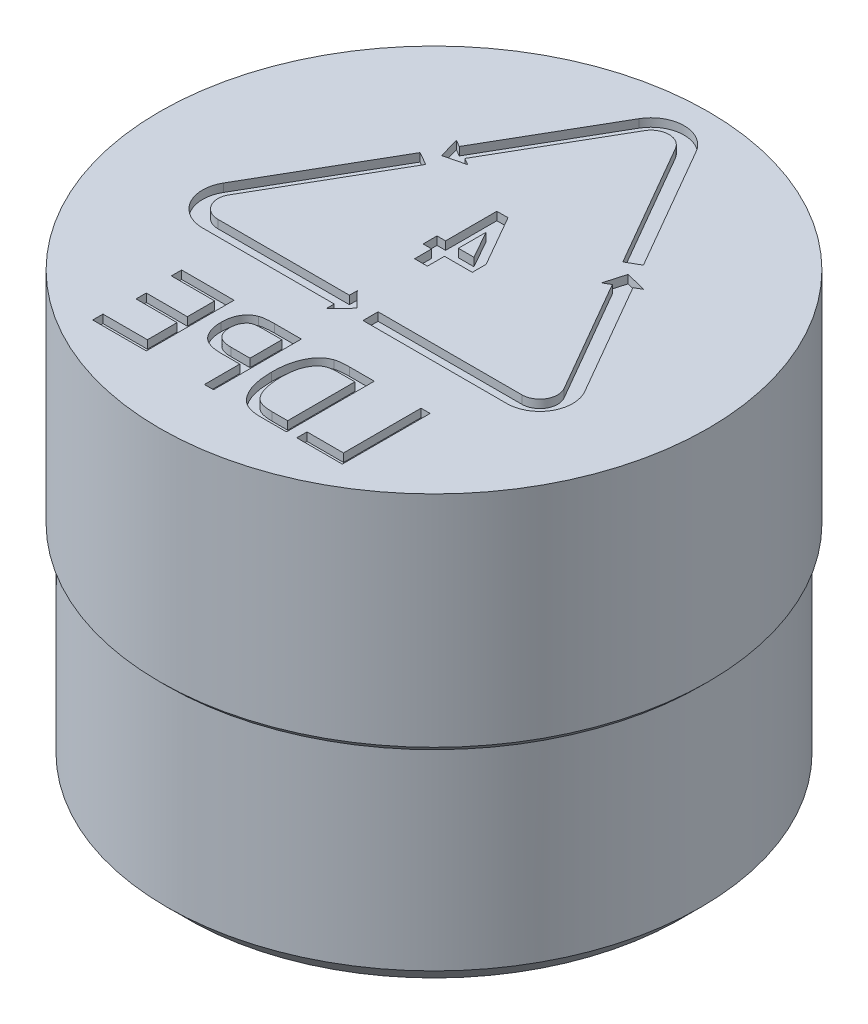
from build123d import *

# Parameters (mm, degrees)
CHAMFER1_SIZE             = 0.76
M6X1_0_TAPPED_HOLE1_D     = 5
M6X1_0_TAPPED_HOLE1_DEPTH = 6
CUT_EXTRUDE2_DEPTH        = 0.3
CUT_EXTRUDE3_DEPTH        = 0.3
CUT_EXTRUDE4_DEPTH        = 0.3


with BuildPart() as part:
    # Sketch1 → Revolve1 (revolve)
    with BuildSketch(Plane.XY, mode=Mode.PRIVATE) as revolve1_sk:
        Polygon((-10, 16), (-10, 8), (-9.745, 7.745), (-9.745, 0), (0, 0), (0, 16), align=None)
    revolve(revolve1_sk.sketch.rotate(Axis((0, 36.769771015, 0), (0, -1, 0)), 270), axis=Axis((0, 36.769771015, 0), (0, -1, 0)))

    # Chamfer1
    chamfer1_edges = [part.edges().sort_by_distance(p)[0] for p in [
        (0, 0, -9.745),
    ]]
    chamfer(chamfer1_edges, length=CHAMFER1_SIZE)

    # M6x1.0 Tapped Hole1
    with Locations(Plane(origin=(0, 0, 0), x_dir=(-1, 0, 0), z_dir=(0, -1, 0))):
        with Locations((0, 0)):
            Hole(M6X1_0_TAPPED_HOLE1_D / 2, depth=M6X1_0_TAPPED_HOLE1_DEPTH)

    # Sketch8 → Cut-Extrude2 (cut)
    with BuildSketch(Plane(origin=(0, 16, 0), x_dir=(1, 0, 0), z_dir=(0, 1, 0))):
        with BuildLine():
            Line((0.565270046, 8.237716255), (3.187916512, 3.695159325))
            Line((3.187916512, 3.695159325), (3.664230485, 3.970159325))
            Line((3.664230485, 3.970159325), (1.039230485, 8.516792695))
            ThreePointArc((1.039230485, 8.516792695), (0, 9.116792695), (-1.039230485, 8.516792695))
            Line((-1.039230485, 8.516792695), (-3.439230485, 4.359870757))
            Line((-3.439230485, 4.359870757), (-3.68753883, 4.503231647))
            Line((-3.68753883, 4.503231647), (-3.471443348, 3.75))
            Line((-3.471443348, 3.75), (-2.711077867, 3.939471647))
            Line((-2.711077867, 3.939471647), (-2.959386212, 4.082832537))
            Line((-2.959386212, 4.082832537), (-0.560562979, 8.237716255))
            ThreePointArc((-0.560562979, 8.237716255), (0.002353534, 8.562716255), (0.565270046, 8.237716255))
        make_face()
        with BuildLine():
            Line((-3.959600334, 3.454487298), (-6.584600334, -1.092146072))
            ThreePointArc((-6.584600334, -1.092146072), (-6.584600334, -2.292146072), (-5.54536985, -2.892146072))
            Line((-5.54536985, -2.892146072), (-0.74536985, -2.892146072))
            Line((-0.74536985, -2.892146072), (-0.74536985, -3.178867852))
            Line((-0.74536985, -3.178867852), (-0.20109985, -2.615107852))
            Line((-0.20109985, -2.615107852), (-0.74536985, -2.051347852))
            Line((-0.74536985, -2.051347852), (-0.74536985, -2.338069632))
            Line((-0.74536985, -2.338069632), (-5.543016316, -2.338069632))
            ThreePointArc((-5.543016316, -2.338069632), (-6.105932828, -2.013069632), (-6.105932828, -1.363069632))
            Line((-6.105932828, -1.363069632), (-3.483286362, 3.179487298))
            Line((-3.483286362, 3.179487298), (-3.959600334, 3.454487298))
        make_face()
        with BuildLine():
            Line((6.585508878, -1.089646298), (4.185774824, 3.066815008))
            Line((4.185774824, 3.066815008), (4.433606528, 3.210998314))
            Line((4.433606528, 3.210998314), (3.676073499, 3.399646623))
            Line((3.676073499, 3.399646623), (3.462543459, 2.646054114))
            Line((3.462543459, 2.646054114), (3.710375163, 2.79023742))
            Line((3.710375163, 2.79023742), (6.109198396, -1.364646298))
            ThreePointArc((6.109198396, -1.364646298), (6.109198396, -2.014646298), (5.546281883, -2.339646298))
            Line((5.546281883, -2.339646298), (0.300988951, -2.339646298))
            Line((0.300988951, -2.339646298), (0.300988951, -2.889646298))
            Line((0.300988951, -2.889646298), (5.546278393, -2.889646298))
            ThreePointArc((5.546278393, -2.889646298), (6.585508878, -2.289646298), (6.585508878, -1.089646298))
        make_face()
    extrude(amount=-CUT_EXTRUDE2_DEPTH, mode=Mode.SUBTRACT)

    # Sketch12 → Cut-Extrude3 (cut)
    with BuildSketch(Plane(origin=(0, 16, 0), x_dir=(1, 0, 0), z_dir=(0, 1, 0))):
        Polygon((-0.240909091, 0), (-0.240909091, 0.623376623), (0.772077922, 0.623376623), (0.772077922, 1.128043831), (-0.301785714, 3), (-0.708441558, 3), (-0.708441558, 1.12987013), (-1.02012987, 1.12987013), (-1.02012987, 0.623376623), (-0.708441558, 0.623376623), (-0.708441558, 0), align=None)
        Polygon((-0.240909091, 1.12987013), (-0.240909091, 2.137378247), (0.327069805, 1.12987013), align=None, mode=Mode.SUBTRACT)
    extrude(amount=-CUT_EXTRUDE3_DEPTH, mode=Mode.SUBTRACT)

    # Sketch13 → Cut-Extrude4 (cut)
    # profile 1 of 4: a face of its own
    with BuildSketch(Plane(origin=(0, 16, 0), x_dir=(1, 0, 0), z_dir=(0, 1, 0))):
        Polygon((4.459090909, -7.8), (4.459090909, -4.6), (4.126623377, -4.6), (4.126623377, -7.425974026), (2.796753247, -7.425974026), (2.796753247, -7.8), align=None)
    # profile 2 of 4: a face of its own
    with BuildSketch(Plane(origin=(0, 16, 0), x_dir=(1, 0, 0), z_dir=(0, 1, 0))):
        with BuildLine():
            Line((2.422727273, -7.8), (2.422727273, -4.6))
            Line((2.422727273, -4.6), (1.520779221, -4.6))
            add(Edge.make_bspline(
                [(1.520779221, -4.6), (1.493717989, -4.59999174), (1.44108885, -4.599975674), (1.36489594, -4.603647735), (1.293634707, -4.607922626), (1.227542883, -4.614245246), (1.166330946, -4.622998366), (1.10998874, -4.63201256), (1.058968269, -4.64467084), (1.027017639, -4.654415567), (1.011688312, -4.659090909)],
                knots=[0, 0, 0, 0, 1.26215185, 2.454654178, 3.557482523, 4.592303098, 5.550444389, 6.441834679, 7.252420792, 8, 8, 8, 8], degree=3))
            add(Edge.make_bspline(
                [(1.011688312, -4.659090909), (0.974377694, -4.673352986), (0.899730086, -4.701887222), (0.79614724, -4.765140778), (0.700745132, -4.844099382), (0.612800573, -4.938149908), (0.533951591, -5.047136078), (0.463550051, -5.169160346), (0.403334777, -5.304708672), (0.352008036, -5.453205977), (0.311145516, -5.615430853), (0.28238387, -5.791795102), (0.264748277, -5.982323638), (0.262731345, -6.114245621), (0.261688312, -6.182467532)],
                knots=[0, 0, 0, 0, 0.793557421, 1.587675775, 2.401718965, 3.251938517, 4.142780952, 5.072951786, 6.050439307, 7.089810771, 8.196152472, 9.375194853, 10.64261269, 12, 12, 12, 12], degree=3))
            add(Edge.make_bspline(
                [(0.261688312, -6.182467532), (0.262234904, -6.226848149), (0.263310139, -6.314151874), (0.270342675, -6.442428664), (0.282701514, -6.565709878), (0.299929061, -6.683661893), (0.322999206, -6.796462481), (0.349849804, -6.904363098), (0.382497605, -7.007030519), (0.419244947, -7.104199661), (0.460167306, -7.195207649), (0.50440274, -7.279642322), (0.550726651, -7.357612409), (0.600422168, -7.428398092), (0.653107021, -7.492099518), (0.708207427, -7.549479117), (0.766206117, -7.600061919), (0.827909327, -7.642999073), (0.892935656, -7.680708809), (0.962775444, -7.712149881), (1.037052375, -7.739815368), (1.116484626, -7.761435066), (1.200346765, -7.779156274), (1.289093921, -7.791350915), (1.382567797, -7.798411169), (1.446524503, -7.799462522), (1.479220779, -7.8)],
                knots=[0, 0, 0, 0, 1.386128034, 2.726734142, 4.010873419, 5.254715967, 6.447944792, 7.605518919, 8.725856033, 9.810649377, 10.848506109, 11.840315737, 12.786373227, 13.679144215, 14.538661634, 15.36577154, 16.161365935, 16.93783141, 17.710106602, 18.505700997, 19.327016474, 20.183204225, 21.074181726, 22.002513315, 22.978834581, 24, 24, 24, 24], degree=3))
            Line((1.479220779, -7.8), (2.422727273, -7.8))
        make_face()
        with BuildLine():
            Line((2.09025974, -7.425974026), (1.519480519, -7.425974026))
            add(Edge.make_bspline(
                [(1.519480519, -7.425974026), (1.491548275, -7.425583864), (1.437365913, -7.424827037), (1.358727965, -7.419470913), (1.285126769, -7.411553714), (1.217022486, -7.39867611), (1.153632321, -7.384778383), (1.096341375, -7.364416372), (1.043295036, -7.342995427), (0.995326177, -7.316574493), (0.951466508, -7.28621617), (0.910165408, -7.252566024), (0.872387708, -7.213584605), (0.836958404, -7.170915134), (0.80345348, -7.124455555), (0.772840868, -7.073744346), (0.745819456, -7.018245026), (0.729675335, -6.979521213), (0.721428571, -6.95974026)],
                knots=[0, 0, 0, 0, 1.342011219, 2.603204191, 3.786198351, 4.895972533, 5.932780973, 6.899736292, 7.813372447, 8.679106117, 9.524356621, 10.373947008, 11.234417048, 12.127941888, 13.037127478, 13.984247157, 14.970310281, 16, 16, 16, 16], degree=3))
            add(Edge.make_bspline(
                [(0.721428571, -6.95974026), (0.711166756, -6.931923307), (0.690355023, -6.875508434), (0.664420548, -6.787707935), (0.643462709, -6.695834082), (0.624709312, -6.600235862), (0.611786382, -6.500187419), (0.60094337, -6.396304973), (0.595296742, -6.288375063), (0.594540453, -6.215156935), (0.594155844, -6.177922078)],
                knots=[0, 0, 0, 0, 0.893165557, 1.811406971, 2.755792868, 3.73169534, 4.74530742, 5.793958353, 6.878124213, 8, 8, 8, 8], degree=3))
            add(Edge.make_bspline(
                [(0.594155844, -6.177922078), (0.594439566, -6.1383002), (0.594991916, -6.06116409), (0.601866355, -5.948762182), (0.611688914, -5.84294108), (0.626980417, -5.74376638), (0.645165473, -5.650996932), (0.668987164, -5.564843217), (0.695587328, -5.484863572), (0.727866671, -5.411801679), (0.763022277, -5.345035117), (0.79983793, -5.2835288), (0.839796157, -5.22812838), (0.881543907, -5.177810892), (0.926968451, -5.134352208), (0.973460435, -5.095456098), (1.023383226, -5.063326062), (1.058478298, -5.046200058), (1.075974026, -5.037662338)],
                knots=[0, 0, 0, 0, 1.456923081, 2.836346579, 4.140104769, 5.363837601, 6.525326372, 7.61445734, 8.64907664, 9.622216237, 10.547970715, 11.423056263, 12.255883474, 13.05801533, 13.823608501, 14.564597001, 15.284417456, 16, 16, 16, 16], degree=3))
            add(Edge.make_bspline(
                [(1.075974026, -5.037662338), (1.088665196, -5.03246306), (1.115369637, -5.021522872), (1.159149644, -5.008896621), (1.207945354, -4.997960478), (1.261886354, -4.988729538), (1.321147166, -4.982849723), (1.385615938, -4.977146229), (1.455400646, -4.975122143), (1.503680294, -4.974398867), (1.528571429, -4.974025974)],
                knots=[0, 0, 0, 0, 0.715245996, 1.505002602, 2.37361077, 3.324331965, 4.358357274, 5.480199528, 6.700887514, 8, 8, 8, 8], degree=3))
            Line((1.528571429, -4.974025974), (2.09025974, -4.974025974))
            Line((2.09025974, -4.974025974), (2.09025974, -7.425974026))
        make_face(mode=Mode.SUBTRACT)
    # profile 3 of 4: a face of its own
    with BuildSketch(Plane(origin=(0, 16, 0), x_dir=(1, 0, 0), z_dir=(0, 1, 0))):
        with BuildLine():
            Line((-0.237012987, -7.8), (-0.237012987, -4.6))
            Line((-0.237012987, -4.6), (-1.222727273, -4.6))
            add(Edge.make_bspline(
                [(-1.222727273, -4.6), (-1.25087176, -4.59997359), (-1.305017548, -4.599922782), (-1.383361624, -4.603755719), (-1.456198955, -4.607628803), (-1.523274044, -4.615102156), (-1.58463764, -4.623262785), (-1.640227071, -4.633460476), (-1.690053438, -4.646348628), (-1.721047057, -4.656760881), (-1.735714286, -4.661688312)],
                knots=[0, 0, 0, 0, 1.301145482, 2.503209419, 3.626350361, 4.67304202, 5.622796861, 6.488461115, 7.284688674, 8, 8, 8, 8], degree=3))
            add(Edge.make_bspline(
                [(-1.735714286, -4.661688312), (-1.754286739, -4.668876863), (-1.791387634, -4.683236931), (-1.84364637, -4.711586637), (-1.893497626, -4.743525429), (-1.94037643, -4.779885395), (-1.984007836, -4.821226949), (-2.025074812, -4.866641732), (-2.062761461, -4.917063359), (-2.097484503, -4.971417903), (-2.129817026, -5.029156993), (-2.156512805, -5.09098668), (-2.180493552, -5.155603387), (-2.198739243, -5.223763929), (-2.214158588, -5.294986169), (-2.223979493, -5.369485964), (-2.230979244, -5.447269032), (-2.231534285, -5.500199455), (-2.231818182, -5.527272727)],
                knots=[0, 0, 0, 0, 0.897158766, 1.79219156, 2.674738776, 3.564969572, 4.462552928, 5.381685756, 6.322532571, 7.297145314, 8.28871417, 9.302465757, 10.330585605, 11.393732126, 12.480975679, 13.614163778, 14.779673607, 16, 16, 16, 16], degree=3))
            add(Edge.make_bspline(
                [(-2.231818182, -5.527272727), (-2.231268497, -5.562796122), (-2.230193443, -5.63227155), (-2.219638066, -5.733887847), (-2.20209537, -5.830234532), (-2.178160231, -5.921774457), (-2.147074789, -6.008369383), (-2.108582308, -6.089791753), (-2.063426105, -6.166333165), (-2.011873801, -6.238136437), (-1.951124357, -6.303494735), (-1.879428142, -6.359408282), (-1.798310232, -6.407229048), (-1.70675799, -6.445239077), (-1.605705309, -6.475940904), (-1.494236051, -6.496870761), (-1.372780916, -6.508993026), (-1.288557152, -6.510766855), (-1.244805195, -6.511688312)],
                knots=[0, 0, 0, 0, 1.066125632, 2.085091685, 3.062630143, 4.003547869, 4.922307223, 5.820454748, 6.703048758, 7.586837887, 8.469431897, 9.371589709, 10.306565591, 11.287746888, 12.340181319, 13.471797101, 14.68666727, 16, 16, 16, 16], degree=3))
            Line((-1.244805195, -6.511688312), (-0.569480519, -6.511688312))
            Line((-0.569480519, -6.511688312), (-0.569480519, -7.8))
            Line((-0.569480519, -7.8), (-0.237012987, -7.8))
        make_face()
        with BuildLine():
            Line((-0.569480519, -6.137662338), (-1.265584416, -6.137662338))
            add(Edge.make_bspline(
                [(-1.265584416, -6.137662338), (-1.292001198, -6.137068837), (-1.343183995, -6.135918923), (-1.417473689, -6.129785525), (-1.486287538, -6.118087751), (-1.549603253, -6.102068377), (-1.607244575, -6.081179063), (-1.659499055, -6.056060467), (-1.706068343, -6.02582738), (-1.747686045, -5.991271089), (-1.783156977, -5.951120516), (-1.815064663, -5.907384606), (-1.840941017, -5.85799822), (-1.862087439, -5.804133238), (-1.879264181, -5.745965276), (-1.890597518, -5.683042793), (-1.897841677, -5.615537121), (-1.898837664, -5.568850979), (-1.899350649, -5.544805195)],
                knots=[0, 0, 0, 0, 1.269306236, 2.459294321, 3.577321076, 4.618943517, 5.592639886, 6.518111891, 7.397820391, 8.253919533, 9.107995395, 9.965041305, 10.848919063, 11.777714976, 12.741869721, 13.757527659, 14.845010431, 16, 16, 16, 16], degree=3))
            add(Edge.make_bspline(
                [(-1.899350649, -5.544805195), (-1.898612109, -5.513571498), (-1.897182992, -5.4531325), (-1.88240061, -5.366197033), (-1.859533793, -5.286001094), (-1.826066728, -5.214157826), (-1.786927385, -5.151158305), (-1.744070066, -5.097266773), (-1.696203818, -5.054927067), (-1.651656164, -5.028537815), (-1.612533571, -5.011894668), (-1.577670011, -5.001624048), (-1.537412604, -4.993556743), (-1.491906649, -4.986492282), (-1.44124079, -4.980535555), (-1.385318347, -4.977026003), (-1.324055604, -4.974146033), (-1.281389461, -4.974067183), (-1.259090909, -4.974025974)],
                knots=[0, 0, 0, 0, 1.500314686, 2.903195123, 4.226916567, 5.498136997, 6.699407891, 7.786731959, 8.797026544, 9.75363827, 10.261964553, 10.838097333, 11.497334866, 12.234733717, 13.051831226, 13.948971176, 14.928073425, 16, 16, 16, 16], degree=3))
            Line((-1.259090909, -4.974025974), (-0.569480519, -4.974025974))
            Line((-0.569480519, -4.974025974), (-0.569480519, -6.137662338))
        make_face(mode=Mode.SUBTRACT)
    # profile 4 of 4: a face of its own
    with BuildSketch(Plane(origin=(0, 16, 0), x_dir=(1, 0, 0), z_dir=(0, 1, 0))):
        Polygon((-2.688961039, -7.8), (-2.688961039, -4.6), (-4.600649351, -4.6), (-4.600649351, -4.974025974), (-3.021428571, -4.974025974), (-3.021428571, -5.971428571), (-4.517532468, -5.971428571), (-4.517532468, -6.345454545), (-3.021428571, -6.345454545), (-3.021428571, -7.425974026), (-4.642207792, -7.425974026), (-4.642207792, -7.8), align=None)
    extrude(amount=-CUT_EXTRUDE4_DEPTH, mode=Mode.SUBTRACT)


solid = part.part
